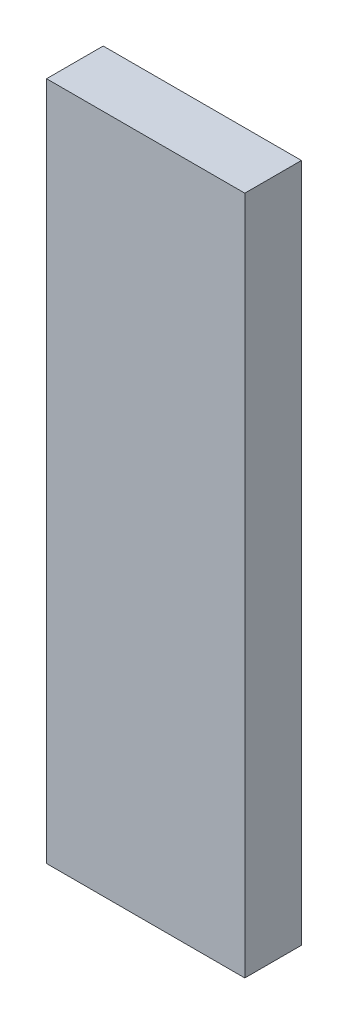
from build123d import *

# Parameters (mm, degrees)
SKETCH1_W           = 133.35
SKETCH1_H           = 38.1
BOSS_EXTRUDE1_DEPTH = 457.2


with BuildPart() as part:
    # Sketch1 → Boss-Extrude1 (new body)
    with BuildSketch(Plane(origin=(0, 0, 0), x_dir=(1, 0, 0), z_dir=(0, 1, 0))):
        Rectangle(SKETCH1_W, SKETCH1_H)
    extrude(amount=BOSS_EXTRUDE1_DEPTH)


solid = part.part
